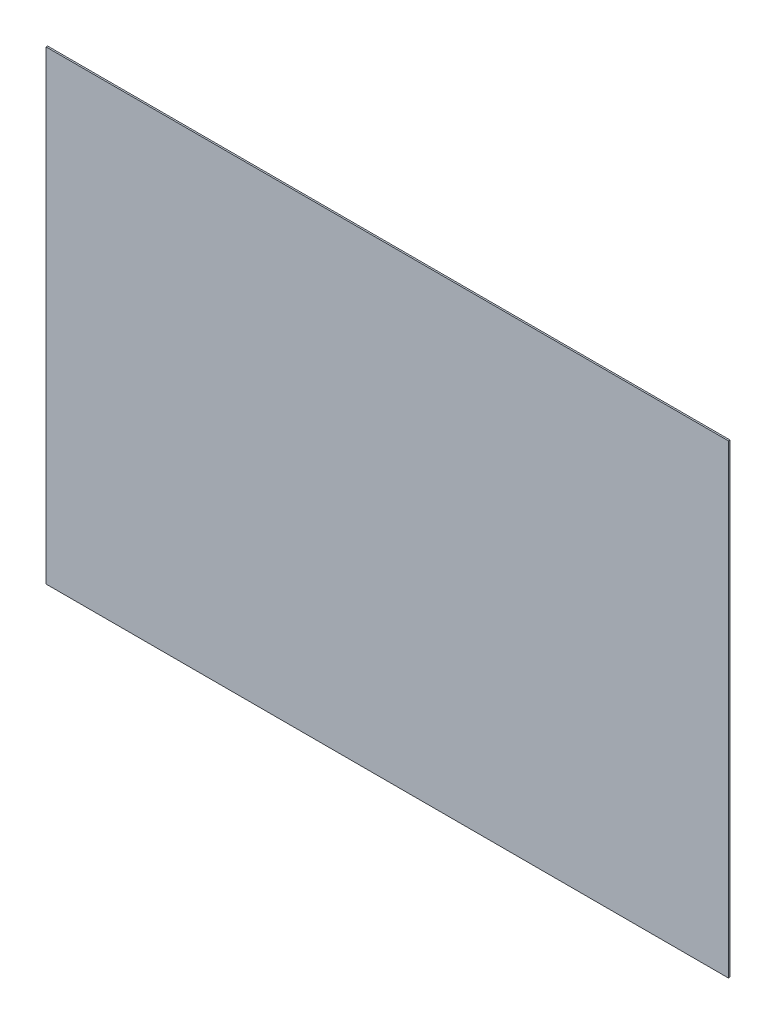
from build123d import *

# Parameters (mm, degrees)
ESQUISSE1_W          = 2200
ESQUISSE1_H          = 1500
BASE_EXTRUSION_DEPTH = 5


with BuildPart() as part:
    # Esquisse1 → Base-Extrusion (new body)
    with BuildSketch(Plane.XY):
        Rectangle(ESQUISSE1_W, ESQUISSE1_H)
    extrude(amount=BASE_EXTRUSION_DEPTH)


solid = part.part
